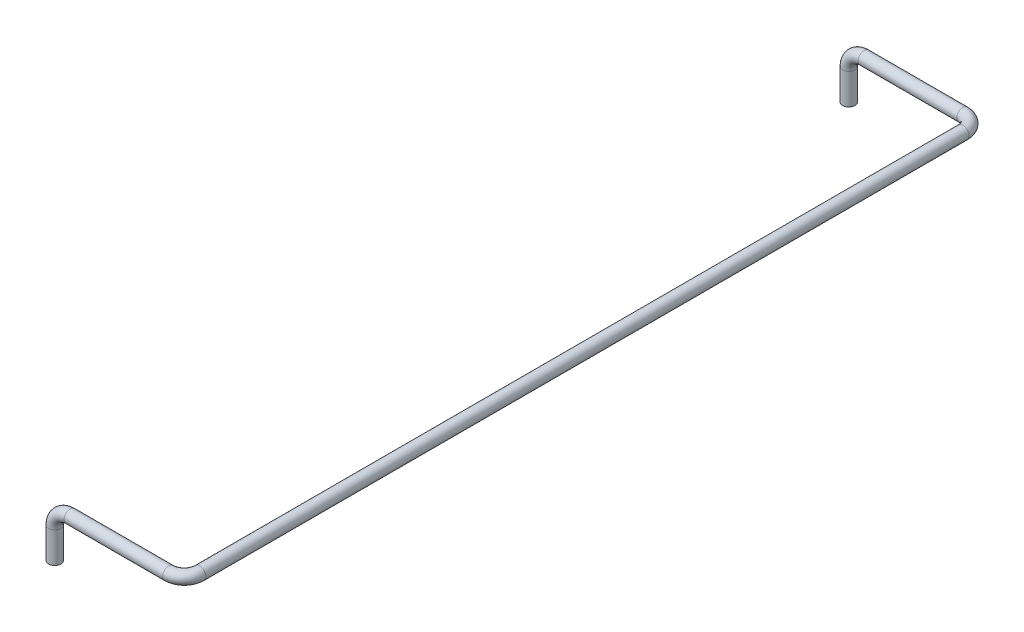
ISO-10303-21;
HEADER;
FILE_DESCRIPTION(('STEP AP214'),'2;1');
FILE_NAME('part.step','',(''),(''),'','','');
FILE_SCHEMA(('AUTOMOTIVE_DESIGN { 1 0 10303 214 1 1 1 1 }'));
ENDSEC;
DATA;
#1=APPLICATION_CONTEXT('core data for automotive mechanical design processes');
#2=APPLICATION_PROTOCOL_DEFINITION('international standard','automotive_design',2000,#1);
#3=PRODUCT_CONTEXT('',#1,'mechanical');
#4=PRODUCT('Part','Part','',(#3));
#5=PRODUCT_RELATED_PRODUCT_CATEGORY('part','',(#4));
#6=PRODUCT_DEFINITION_FORMATION('','',#4);
#7=PRODUCT_DEFINITION_CONTEXT('part definition',#1,'design');
#8=PRODUCT_DEFINITION('design','',#6,#7);
#9=PRODUCT_DEFINITION_SHAPE('','',#8);
#10=(LENGTH_UNIT() NAMED_UNIT(*) SI_UNIT(.MILLI.,.METRE.));
#11=(NAMED_UNIT(*) PLANE_ANGLE_UNIT() SI_UNIT($,.RADIAN.));
#12=(NAMED_UNIT(*) SI_UNIT($,.STERADIAN.) SOLID_ANGLE_UNIT());
#13=UNCERTAINTY_MEASURE_WITH_UNIT(LENGTH_MEASURE(1.E-05),#10,'distance_accuracy_value','');
#14=(GEOMETRIC_REPRESENTATION_CONTEXT(3) GLOBAL_UNCERTAINTY_ASSIGNED_CONTEXT((#13)) GLOBAL_UNIT_ASSIGNED_CONTEXT((#10,
#11,#12)) REPRESENTATION_CONTEXT('',''));
#15=CARTESIAN_POINT('',(0.,0.,0.));
#16=DIRECTION('',(0.,0.,1.));
#17=DIRECTION('',(1.,0.,0.));
#18=AXIS2_PLACEMENT_3D('',#15,#16,#17);
#19=CARTESIAN_POINT('',(0.,1.,0.));
#20=DIRECTION('',(0.,-1.,0.));
#21=DIRECTION('',(0.,0.,-1.));
#22=AXIS2_PLACEMENT_3D('',#19,#20,#21);
#23=CYLINDRICAL_SURFACE('',#22,0.199999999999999);
#24=CARTESIAN_POINT('',(0.,1.,0.));
#25=DIRECTION('',(0.,-1.,0.));
#26=DIRECTION('',(0.,0.,-1.));
#27=AXIS2_PLACEMENT_3D('',#24,#25,#26);
#28=CIRCLE('',#27,0.199999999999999);
#29=CARTESIAN_POINT('',(-0.200000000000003,1.,0.));
#30=VERTEX_POINT('',#29);
#31=EDGE_CURVE('E21',#30,#30,#28,.T.);
#32=ORIENTED_EDGE('',*,*,#31,.T.);
#33=EDGE_LOOP('',(#32));
#34=FACE_BOUND('',#33,.T.);
#35=CARTESIAN_POINT('',(0.,0.,0.));
#36=DIRECTION('',(0.,-1.,0.));
#37=DIRECTION('',(0.,0.,-1.));
#38=AXIS2_PLACEMENT_3D('',#35,#36,#37);
#39=CIRCLE('',#38,0.199999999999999);
#40=CARTESIAN_POINT('',(0.,0.,-0.199999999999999));
#41=VERTEX_POINT('',#40);
#42=EDGE_CURVE('E10',#41,#41,#39,.T.);
#43=ORIENTED_EDGE('',*,*,#42,.F.);
#44=EDGE_LOOP('',(#43));
#45=FACE_BOUND('',#44,.T.);
#46=ADVANCED_FACE('F15',(#34,#45),#23,.T.);
#47=CARTESIAN_POINT('',(0.5,1.,0.));
#48=DIRECTION('',(0.,0.,1.));
#49=DIRECTION('',(1.,0.,0.));
#50=AXIS2_PLACEMENT_3D('',#47,#48,#49);
#51=TOROIDAL_SURFACE('',#50,0.500000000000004,0.199999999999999);
#52=CARTESIAN_POINT('',(0.500000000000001,1.5,0.));
#53=DIRECTION('',(-1.,0.,0.));
#54=DIRECTION('',(0.,0.,-1.));
#55=AXIS2_PLACEMENT_3D('',#52,#53,#54);
#56=CIRCLE('',#55,0.199999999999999);
#57=CARTESIAN_POINT('',(0.500000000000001,1.7,0.));
#58=VERTEX_POINT('',#57);
#59=EDGE_CURVE('E25',#58,#58,#56,.T.);
#60=CARTESIAN_POINT('',(0.5,1.,0.));
#61=DIRECTION('',(0.,0.,1.));
#62=DIRECTION('',(1.,0.,0.));
#63=AXIS2_PLACEMENT_3D('',#60,#61,#62);
#64=CIRCLE('',#63,0.700000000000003);
#65=EDGE_CURVE('',#58,#30,#64,.T.);
#66=ORIENTED_EDGE('',*,*,#59,.T.);
#67=ORIENTED_EDGE('',*,*,#31,.F.);
#68=ORIENTED_EDGE('',*,*,#65,.T.);
#69=ORIENTED_EDGE('',*,*,#65,.F.);
#70=EDGE_LOOP('',(#66,#68,#67,#69));
#71=FACE_BOUND('',#70,.T.);
#72=ADVANCED_FACE('F72',(#71),#51,.T.);
#73=CARTESIAN_POINT('',(3.7,1.5,0.));
#74=DIRECTION('',(-1.,0.,0.));
#75=DIRECTION('',(0.,-1.,0.));
#76=AXIS2_PLACEMENT_3D('',#73,#74,#75);
#77=CYLINDRICAL_SURFACE('',#76,0.199999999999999);
#78=CARTESIAN_POINT('',(3.7,1.5,0.));
#79=DIRECTION('',(-1.,0.,0.));
#80=DIRECTION('',(0.,0.,-1.));
#81=AXIS2_PLACEMENT_3D('',#78,#79,#80);
#82=CIRCLE('',#81,0.199999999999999);
#83=CARTESIAN_POINT('',(3.7,1.5,0.199999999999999));
#84=VERTEX_POINT('',#83);
#85=EDGE_CURVE('E29',#84,#84,#82,.T.);
#86=ORIENTED_EDGE('',*,*,#85,.T.);
#87=EDGE_LOOP('',(#86));
#88=FACE_BOUND('',#87,.T.);
#89=ORIENTED_EDGE('',*,*,#59,.F.);
#90=EDGE_LOOP('',(#89));
#91=FACE_BOUND('',#90,.T.);
#92=ADVANCED_FACE('F76',(#88,#91),#77,.T.);
#93=CARTESIAN_POINT('',(3.7,1.5,-0.5));
#94=DIRECTION('',(0.,-1.,0.));
#95=DIRECTION('',(0.,0.,-1.));
#96=AXIS2_PLACEMENT_3D('',#93,#94,#95);
#97=TOROIDAL_SURFACE('',#96,0.5,0.199999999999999);
#98=CARTESIAN_POINT('',(4.2,1.5,-0.5));
#99=DIRECTION('',(0.,0.,1.));
#100=DIRECTION('',(-1.,0.,0.));
#101=AXIS2_PLACEMENT_3D('',#98,#99,#100);
#102=CIRCLE('',#101,0.199999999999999);
#103=CARTESIAN_POINT('',(4.4,1.5,-0.500000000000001));
#104=VERTEX_POINT('',#103);
#105=EDGE_CURVE('E34',#104,#104,#102,.T.);
#106=CARTESIAN_POINT('',(3.7,1.5,-0.5));
#107=DIRECTION('',(0.,-1.,0.));
#108=DIRECTION('',(0.,0.,-1.));
#109=AXIS2_PLACEMENT_3D('',#106,#107,#108);
#110=CIRCLE('',#109,0.699999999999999);
#111=EDGE_CURVE('',#104,#84,#110,.T.);
#112=ORIENTED_EDGE('',*,*,#105,.T.);
#113=ORIENTED_EDGE('',*,*,#85,.F.);
#114=ORIENTED_EDGE('',*,*,#111,.T.);
#115=ORIENTED_EDGE('',*,*,#111,.F.);
#116=EDGE_LOOP('',(#112,#114,#113,#115));
#117=FACE_BOUND('',#116,.T.);
#118=ADVANCED_FACE('F82',(#117),#97,.T.);
#119=CARTESIAN_POINT('',(4.2,1.5,-25.25));
#120=DIRECTION('',(0.,0.,1.));
#121=DIRECTION('',(1.,0.,0.));
#122=AXIS2_PLACEMENT_3D('',#119,#120,#121);
#123=CYLINDRICAL_SURFACE('',#122,0.199999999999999);
#124=CARTESIAN_POINT('',(4.2,1.5,-25.25));
#125=DIRECTION('',(0.,0.,1.));
#126=DIRECTION('',(-1.,0.,0.));
#127=AXIS2_PLACEMENT_3D('',#124,#125,#126);
#128=CIRCLE('',#127,0.199999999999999);
#129=CARTESIAN_POINT('',(4.4,1.5,-25.25));
#130=VERTEX_POINT('',#129);
#131=EDGE_CURVE('E37',#130,#130,#128,.T.);
#132=ORIENTED_EDGE('',*,*,#131,.T.);
#133=EDGE_LOOP('',(#132));
#134=FACE_BOUND('',#133,.T.);
#135=ORIENTED_EDGE('',*,*,#105,.F.);
#136=EDGE_LOOP('',(#135));
#137=FACE_BOUND('',#136,.T.);
#138=ADVANCED_FACE('F89',(#134,#137),#123,.T.);
#139=CARTESIAN_POINT('',(3.7,1.5,-25.25));
#140=DIRECTION('',(0.,-1.,0.));
#141=DIRECTION('',(0.,0.,-1.));
#142=AXIS2_PLACEMENT_3D('',#139,#140,#141);
#143=TOROIDAL_SURFACE('',#142,0.5,0.199999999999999);
#144=CARTESIAN_POINT('',(3.69999999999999,1.5,-25.75));
#145=DIRECTION('',(1.,0.,0.));
#146=DIRECTION('',(0.,0.,1.));
#147=AXIS2_PLACEMENT_3D('',#144,#145,#146);
#148=CIRCLE('',#147,0.199999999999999);
#149=CARTESIAN_POINT('',(3.69999999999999,1.5,-25.95));
#150=VERTEX_POINT('',#149);
#151=EDGE_CURVE('E40',#150,#150,#148,.T.);
#152=CARTESIAN_POINT('',(3.7,1.5,-25.25));
#153=DIRECTION('',(0.,-1.,0.));
#154=DIRECTION('',(0.,0.,-1.));
#155=AXIS2_PLACEMENT_3D('',#152,#153,#154);
#156=CIRCLE('',#155,0.7);
#157=EDGE_CURVE('',#150,#130,#156,.T.);
#158=ORIENTED_EDGE('',*,*,#151,.T.);
#159=ORIENTED_EDGE('',*,*,#131,.F.);
#160=ORIENTED_EDGE('',*,*,#157,.T.);
#161=ORIENTED_EDGE('',*,*,#157,.F.);
#162=EDGE_LOOP('',(#158,#160,#159,#161));
#163=FACE_BOUND('',#162,.T.);
#164=ADVANCED_FACE('F93',(#163),#143,.T.);
#165=CARTESIAN_POINT('',(0.499999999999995,1.5,-25.75));
#166=DIRECTION('',(1.,0.,0.));
#167=DIRECTION('',(0.,1.,0.));
#168=AXIS2_PLACEMENT_3D('',#165,#166,#167);
#169=CYLINDRICAL_SURFACE('',#168,0.199999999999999);
#170=CARTESIAN_POINT('',(0.499999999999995,1.5,-25.75));
#171=DIRECTION('',(1.,0.,0.));
#172=DIRECTION('',(0.,0.,1.));
#173=AXIS2_PLACEMENT_3D('',#170,#171,#172);
#174=CIRCLE('',#173,0.199999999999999);
#175=CARTESIAN_POINT('',(0.499999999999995,1.7,-25.75));
#176=VERTEX_POINT('',#175);
#177=EDGE_CURVE('E43',#176,#176,#174,.T.);
#178=ORIENTED_EDGE('',*,*,#177,.T.);
#179=EDGE_LOOP('',(#178));
#180=FACE_BOUND('',#179,.T.);
#181=ORIENTED_EDGE('',*,*,#151,.F.);
#182=EDGE_LOOP('',(#181));
#183=FACE_BOUND('',#182,.T.);
#184=ADVANCED_FACE('F97',(#180,#183),#169,.T.);
#185=CARTESIAN_POINT('',(0.499999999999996,1.,-25.75));
#186=DIRECTION('',(0.,0.,-1.));
#187=DIRECTION('',(-1.,0.,0.));
#188=AXIS2_PLACEMENT_3D('',#185,#186,#187);
#189=TOROIDAL_SURFACE('',#188,0.5,0.199999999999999);
#190=CARTESIAN_POINT('',(0.,1.,-25.75));
#191=DIRECTION('',(0.,1.,0.));
#192=DIRECTION('',(0.,0.,1.));
#193=AXIS2_PLACEMENT_3D('',#190,#191,#192);
#194=CIRCLE('',#193,0.199999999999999);
#195=CARTESIAN_POINT('',(-0.200000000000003,0.999999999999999,-25.75));
#196=VERTEX_POINT('',#195);
#197=EDGE_CURVE('E46',#196,#196,#194,.T.);
#198=CARTESIAN_POINT('',(0.499999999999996,1.,-25.75));
#199=DIRECTION('',(0.,0.,-1.));
#200=DIRECTION('',(-1.,0.,0.));
#201=AXIS2_PLACEMENT_3D('',#198,#199,#200);
#202=CIRCLE('',#201,0.699999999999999);
#203=EDGE_CURVE('',#196,#176,#202,.T.);
#204=ORIENTED_EDGE('',*,*,#197,.T.);
#205=ORIENTED_EDGE('',*,*,#177,.F.);
#206=ORIENTED_EDGE('',*,*,#203,.T.);
#207=ORIENTED_EDGE('',*,*,#203,.F.);
#208=EDGE_LOOP('',(#204,#206,#205,#207));
#209=FACE_BOUND('',#208,.T.);
#210=ADVANCED_FACE('F53',(#209),#189,.T.);
#211=CARTESIAN_POINT('',(0.,1.,-25.75));
#212=DIRECTION('',(0.,-1.,0.));
#213=DIRECTION('',(1.,0.,0.));
#214=AXIS2_PLACEMENT_3D('',#211,#212,#213);
#215=CYLINDRICAL_SURFACE('',#214,0.199999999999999);
#216=ORIENTED_EDGE('',*,*,#197,.F.);
#217=EDGE_LOOP('',(#216));
#218=FACE_BOUND('',#217,.T.);
#219=CARTESIAN_POINT('',(0.,0.,-25.75));
#220=DIRECTION('',(0.,1.,0.));
#221=DIRECTION('',(0.,0.,1.));
#222=AXIS2_PLACEMENT_3D('',#219,#220,#221);
#223=CIRCLE('',#222,0.199999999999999);
#224=CARTESIAN_POINT('',(0.,0.,-25.55));
#225=VERTEX_POINT('',#224);
#226=EDGE_CURVE('E47',#225,#225,#223,.T.);
#227=ORIENTED_EDGE('',*,*,#226,.T.);
#228=EDGE_LOOP('',(#227));
#229=FACE_BOUND('',#228,.T.);
#230=ADVANCED_FACE('F56',(#218,#229),#215,.T.);
#231=CARTESIAN_POINT('',(0.,0.,0.));
#232=DIRECTION('',(0.,-1.,0.));
#233=DIRECTION('',(0.,0.,-1.));
#234=AXIS2_PLACEMENT_3D('',#231,#232,#233);
#235=PLANE('',#234);
#236=ORIENTED_EDGE('',*,*,#42,.T.);
#237=EDGE_LOOP('',(#236));
#238=FACE_BOUND('',#237,.T.);
#239=ADVANCED_FACE('F59',(#238),#235,.T.);
#240=CARTESIAN_POINT('',(0.,0.,-25.75));
#241=DIRECTION('',(0.,1.,0.));
#242=DIRECTION('',(0.,0.,1.));
#243=AXIS2_PLACEMENT_3D('',#240,#241,#242);
#244=PLANE('',#243);
#245=ORIENTED_EDGE('',*,*,#226,.F.);
#246=EDGE_LOOP('',(#245));
#247=FACE_BOUND('',#246,.T.);
#248=ADVANCED_FACE('F63',(#247),#244,.F.);
#249=CLOSED_SHELL('',(#46,#72,#92,#118,#138,#164,#184,#210,#230,#239,#248));
#250=MANIFOLD_SOLID_BREP('B1',#249);
#251=ADVANCED_BREP_SHAPE_REPRESENTATION('',(#18,#250),#14);
#252=SHAPE_DEFINITION_REPRESENTATION(#9,#251);
ENDSEC;
END-ISO-10303-21;
